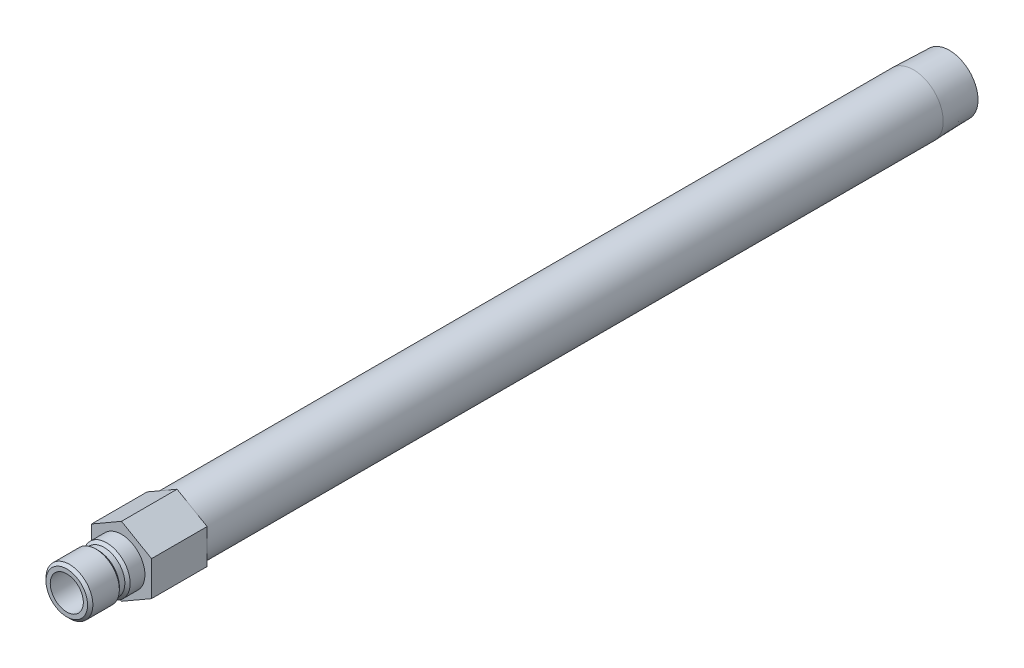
ISO-10303-21;
HEADER;
FILE_DESCRIPTION(('STEP AP214'),'2;1');
FILE_NAME('part.step','',(''),(''),'','','');
FILE_SCHEMA(('AUTOMOTIVE_DESIGN { 1 0 10303 214 1 1 1 1 }'));
ENDSEC;
DATA;
#1=APPLICATION_CONTEXT('core data for automotive mechanical design processes');
#2=APPLICATION_PROTOCOL_DEFINITION('international standard','automotive_design',2000,#1);
#3=PRODUCT_CONTEXT('',#1,'mechanical');
#4=PRODUCT('Part','Part','',(#3));
#5=PRODUCT_RELATED_PRODUCT_CATEGORY('part','',(#4));
#6=PRODUCT_DEFINITION_FORMATION('','',#4);
#7=PRODUCT_DEFINITION_CONTEXT('part definition',#1,'design');
#8=PRODUCT_DEFINITION('design','',#6,#7);
#9=PRODUCT_DEFINITION_SHAPE('','',#8);
#10=(LENGTH_UNIT() NAMED_UNIT(*) SI_UNIT(.MILLI.,.METRE.));
#11=(NAMED_UNIT(*) PLANE_ANGLE_UNIT() SI_UNIT($,.RADIAN.));
#12=(NAMED_UNIT(*) SI_UNIT($,.STERADIAN.) SOLID_ANGLE_UNIT());
#13=UNCERTAINTY_MEASURE_WITH_UNIT(LENGTH_MEASURE(1.E-05),#10,'distance_accuracy_value','');
#14=(GEOMETRIC_REPRESENTATION_CONTEXT(3) GLOBAL_UNCERTAINTY_ASSIGNED_CONTEXT((#13)) GLOBAL_UNIT_ASSIGNED_CONTEXT((#10,
#11,#12)) REPRESENTATION_CONTEXT('',''));
#15=CARTESIAN_POINT('',(0.,0.,0.));
#16=DIRECTION('',(0.,0.,1.));
#17=DIRECTION('',(1.,0.,0.));
#18=AXIS2_PLACEMENT_3D('',#15,#16,#17);
#19=CARTESIAN_POINT('',(0.,0.,0.));
#20=DIRECTION('',(0.,0.,-1.));
#21=DIRECTION('',(0.,1.,0.));
#22=AXIS2_PLACEMENT_3D('',#19,#20,#21);
#23=CYLINDRICAL_SURFACE('',#22,8.57249999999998);
#24=CARTESIAN_POINT('',(0.,0.,-227.9142));
#25=DIRECTION('',(0.,0.,-1.));
#26=DIRECTION('',(0.,1.,0.));
#27=AXIS2_PLACEMENT_3D('',#24,#25,#26);
#28=CIRCLE('',#27,8.57249999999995);
#29=CARTESIAN_POINT('',(0.,8.5725,-227.9142));
#30=VERTEX_POINT('',#29);
#31=EDGE_CURVE('E168',#30,#30,#28,.T.);
#32=ORIENTED_EDGE('',*,*,#31,.F.);
#33=EDGE_LOOP('',(#32));
#34=FACE_BOUND('',#33,.T.);
#35=CARTESIAN_POINT('',(0.,0.,-16.002));
#36=DIRECTION('',(0.,0.,1.));
#37=DIRECTION('',(1.,0.,0.));
#38=AXIS2_PLACEMENT_3D('',#35,#36,#37);
#39=CIRCLE('',#38,8.57249999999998);
#40=CARTESIAN_POINT('',(8.57249999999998,0.,-16.002));
#41=VERTEX_POINT('',#40);
#42=EDGE_CURVE('E37',#41,#41,#39,.F.);
#43=ORIENTED_EDGE('',*,*,#42,.T.);
#44=EDGE_LOOP('',(#43));
#45=FACE_BOUND('',#44,.T.);
#46=ADVANCED_FACE('F33',(#34,#45),#23,.T.);
#47=CARTESIAN_POINT('',(0.,0.,0.));
#48=DIRECTION('',(0.,0.,-1.));
#49=DIRECTION('',(0.,1.,0.));
#50=AXIS2_PLACEMENT_3D('',#47,#48,#49);
#51=CYLINDRICAL_SURFACE('',#50,4.7625);
#52=CARTESIAN_POINT('',(0.,0.,15.748));
#53=DIRECTION('',(0.,0.,-1.));
#54=DIRECTION('',(0.,1.,0.));
#55=AXIS2_PLACEMENT_3D('',#52,#53,#54);
#56=CIRCLE('',#55,4.7625);
#57=CARTESIAN_POINT('',(0.,4.7625,15.748));
#58=VERTEX_POINT('',#57);
#59=EDGE_CURVE('E144',#58,#58,#56,.T.);
#60=ORIENTED_EDGE('',*,*,#59,.F.);
#61=EDGE_LOOP('',(#60));
#62=FACE_BOUND('',#61,.T.);
#63=CARTESIAN_POINT('',(0.,0.,-16.002));
#64=DIRECTION('',(0.,0.,-1.));
#65=DIRECTION('',(0.,1.,0.));
#66=AXIS2_PLACEMENT_3D('',#63,#64,#65);
#67=CIRCLE('',#66,4.76249999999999);
#68=CARTESIAN_POINT('',(0.,4.7625,-16.002));
#69=VERTEX_POINT('',#68);
#70=EDGE_CURVE('E11',#69,#69,#67,.T.);
#71=ORIENTED_EDGE('',*,*,#70,.T.);
#72=EDGE_LOOP('',(#71));
#73=FACE_BOUND('',#72,.T.);
#74=ADVANCED_FACE('F35',(#62,#73),#51,.F.);
#75=CARTESIAN_POINT('',(0.,4.7625,-16.002));
#76=DIRECTION('',(0.,0.,-1.));
#77=DIRECTION('',(0.,1.,0.));
#78=AXIS2_PLACEMENT_3D('',#75,#76,#77);
#79=PLANE('',#78);
#80=CARTESIAN_POINT('',(0.,0.,-16.002));
#81=DIRECTION('',(0.,0.,-1.));
#82=DIRECTION('',(0.,1.,0.));
#83=AXIS2_PLACEMENT_3D('',#80,#81,#82);
#84=CIRCLE('',#83,6.26109999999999);
#85=CARTESIAN_POINT('',(0.,6.2611,-16.002));
#86=VERTEX_POINT('',#85);
#87=EDGE_CURVE('E43',#86,#86,#84,.T.);
#88=ORIENTED_EDGE('',*,*,#87,.T.);
#89=EDGE_LOOP('',(#88));
#90=FACE_BOUND('',#89,.T.);
#91=ORIENTED_EDGE('',*,*,#70,.F.);
#92=EDGE_LOOP('',(#91));
#93=FACE_BOUND('',#92,.T.);
#94=ADVANCED_FACE('F180',(#90,#93),#79,.T.);
#95=CARTESIAN_POINT('',(0.,0.,0.));
#96=DIRECTION('',(0.,0.,-1.));
#97=DIRECTION('',(0.,1.,0.));
#98=AXIS2_PLACEMENT_3D('',#95,#96,#97);
#99=CYLINDRICAL_SURFACE('',#98,6.26109999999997);
#100=CARTESIAN_POINT('',(0.,0.,-238.252));
#101=DIRECTION('',(0.,0.,-1.));
#102=DIRECTION('',(0.,1.,0.));
#103=AXIS2_PLACEMENT_3D('',#100,#101,#102);
#104=CIRCLE('',#103,6.26109999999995);
#105=CARTESIAN_POINT('',(0.,6.2611,-238.252));
#106=VERTEX_POINT('',#105);
#107=EDGE_CURVE('E174',#106,#106,#104,.T.);
#108=ORIENTED_EDGE('',*,*,#107,.T.);
#109=EDGE_LOOP('',(#108));
#110=FACE_BOUND('',#109,.T.);
#111=ORIENTED_EDGE('',*,*,#87,.F.);
#112=EDGE_LOOP('',(#111));
#113=FACE_BOUND('',#112,.T.);
#114=ADVANCED_FACE('F183',(#110,#113),#99,.F.);
#115=CARTESIAN_POINT('',(0.,8.24944566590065,-238.252));
#116=DIRECTION('',(0.,0.,-1.));
#117=DIRECTION('',(0.,1.,0.));
#118=AXIS2_PLACEMENT_3D('',#115,#116,#117);
#119=PLANE('',#118);
#120=CARTESIAN_POINT('',(0.,0.,-238.252));
#121=DIRECTION('',(0.,0.,-1.));
#122=DIRECTION('',(0.,1.,0.));
#123=AXIS2_PLACEMENT_3D('',#120,#121,#122);
#124=CIRCLE('',#123,8.2494456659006);
#125=CARTESIAN_POINT('',(0.,8.24944566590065,-238.252));
#126=VERTEX_POINT('',#125);
#127=EDGE_CURVE('E171',#126,#126,#124,.T.);
#128=ORIENTED_EDGE('',*,*,#127,.T.);
#129=EDGE_LOOP('',(#128));
#130=FACE_BOUND('',#129,.T.);
#131=ORIENTED_EDGE('',*,*,#107,.F.);
#132=EDGE_LOOP('',(#131));
#133=FACE_BOUND('',#132,.T.);
#134=ADVANCED_FACE('F185',(#130,#133),#119,.T.);
#135=CARTESIAN_POINT('',(0.,0.,-238.252));
#136=DIRECTION('',(0.,0.,1.));
#137=DIRECTION('',(0.,-1.,0.));
#138=AXIS2_PLACEMENT_3D('',#135,#136,#137);
#139=CONICAL_SURFACE('',#138,8.2494456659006,0.0312396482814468);
#140=ORIENTED_EDGE('',*,*,#31,.T.);
#141=EDGE_LOOP('',(#140));
#142=FACE_BOUND('',#141,.T.);
#143=ORIENTED_EDGE('',*,*,#127,.F.);
#144=EDGE_LOOP('',(#143));
#145=FACE_BOUND('',#144,.T.);
#146=ADVANCED_FACE('F192',(#142,#145),#139,.T.);
#147=CARTESIAN_POINT('',(0.,6.7437,0.));
#148=DIRECTION('',(0.,0.,1.));
#149=DIRECTION('',(0.,-1.,0.));
#150=AXIS2_PLACEMENT_3D('',#147,#148,#149);
#151=PLANE('',#150);
#152=CARTESIAN_POINT('',(0.,0.,0.));
#153=DIRECTION('',(0.,0.,-1.));
#154=DIRECTION('',(0.,1.,0.));
#155=AXIS2_PLACEMENT_3D('',#152,#153,#154);
#156=CIRCLE('',#155,6.7437);
#157=CARTESIAN_POINT('',(0.,6.7437,0.));
#158=VERTEX_POINT('',#157);
#159=EDGE_CURVE('E165',#158,#158,#156,.T.);
#160=ORIENTED_EDGE('',*,*,#159,.T.);
#161=EDGE_LOOP('',(#160));
#162=FACE_BOUND('',#161,.T.);
#163=DIRECTION('',(-0.866025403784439,-0.5,0.));
#164=VECTOR('',#163,1.);
#165=CARTESIAN_POINT('',(0.,9.97199384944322,0.));
#166=LINE('',#165,#164);
#167=CARTESIAN_POINT('',(0.,9.97199384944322,0.));
#168=VERTEX_POINT('',#167);
#169=CARTESIAN_POINT('',(-8.636,4.98599692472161,0.));
#170=VERTEX_POINT('',#169);
#171=EDGE_CURVE('E122',#168,#170,#166,.T.);
#172=ORIENTED_EDGE('',*,*,#171,.T.);
#173=DIRECTION('',(0.,-1.,0.));
#174=VECTOR('',#173,1.);
#175=CARTESIAN_POINT('',(-8.636,4.98599692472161,0.));
#176=LINE('',#175,#174);
#177=CARTESIAN_POINT('',(-8.636,-4.98599692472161,0.));
#178=VERTEX_POINT('',#177);
#179=EDGE_CURVE('E125',#170,#178,#176,.T.);
#180=ORIENTED_EDGE('',*,*,#179,.T.);
#181=DIRECTION('',(0.866025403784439,-0.5,0.));
#182=VECTOR('',#181,1.);
#183=CARTESIAN_POINT('',(-8.636,-4.98599692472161,0.));
#184=LINE('',#183,#182);
#185=CARTESIAN_POINT('',(0.,-9.97199384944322,0.));
#186=VERTEX_POINT('',#185);
#187=EDGE_CURVE('E128',#178,#186,#184,.T.);
#188=ORIENTED_EDGE('',*,*,#187,.T.);
#189=DIRECTION('',(0.866025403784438,0.5,0.));
#190=VECTOR('',#189,1.);
#191=CARTESIAN_POINT('',(0.,-9.97199384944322,0.));
#192=LINE('',#191,#190);
#193=CARTESIAN_POINT('',(8.63599999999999,-4.98599692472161,0.));
#194=VERTEX_POINT('',#193);
#195=EDGE_CURVE('E131',#186,#194,#192,.T.);
#196=ORIENTED_EDGE('',*,*,#195,.T.);
#197=DIRECTION('',(0.,1.,0.));
#198=VECTOR('',#197,1.);
#199=CARTESIAN_POINT('',(8.63599999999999,-4.98599692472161,0.));
#200=LINE('',#199,#198);
#201=CARTESIAN_POINT('',(8.636,4.98599692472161,0.));
#202=VERTEX_POINT('',#201);
#203=EDGE_CURVE('E99',#194,#202,#200,.T.);
#204=ORIENTED_EDGE('',*,*,#203,.T.);
#205=DIRECTION('',(-0.866025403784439,0.5,0.));
#206=VECTOR('',#205,1.);
#207=CARTESIAN_POINT('',(8.636,4.98599692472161,0.));
#208=LINE('',#207,#206);
#209=EDGE_CURVE('E134',#202,#168,#208,.T.);
#210=ORIENTED_EDGE('',*,*,#209,.T.);
#211=EDGE_LOOP('',(#172,#180,#188,#196,#204,#210));
#212=FACE_BOUND('',#211,.T.);
#213=ADVANCED_FACE('F206',(#162,#212),#151,.T.);
#214=CARTESIAN_POINT('',(0.,0.,0.));
#215=DIRECTION('',(0.,0.,-1.));
#216=DIRECTION('',(0.,1.,0.));
#217=AXIS2_PLACEMENT_3D('',#214,#215,#216);
#218=CYLINDRICAL_SURFACE('',#217,6.7437);
#219=CARTESIAN_POINT('',(0.,0.,4.25449999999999));
#220=DIRECTION('',(0.,0.,-1.));
#221=DIRECTION('',(0.,1.,0.));
#222=AXIS2_PLACEMENT_3D('',#219,#220,#221);
#223=CIRCLE('',#222,6.7437);
#224=CARTESIAN_POINT('',(0.,6.7437,4.2545));
#225=VERTEX_POINT('',#224);
#226=EDGE_CURVE('E162',#225,#225,#223,.T.);
#227=ORIENTED_EDGE('',*,*,#226,.T.);
#228=EDGE_LOOP('',(#227));
#229=FACE_BOUND('',#228,.T.);
#230=ORIENTED_EDGE('',*,*,#159,.F.);
#231=EDGE_LOOP('',(#230));
#232=FACE_BOUND('',#231,.T.);
#233=ADVANCED_FACE('F213',(#229,#232),#218,.T.);
#234=CARTESIAN_POINT('',(0.,0.,4.25449999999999));
#235=DIRECTION('',(0.,0.,-1.));
#236=DIRECTION('',(0.,1.,0.));
#237=AXIS2_PLACEMENT_3D('',#234,#235,#236);
#238=CONICAL_SURFACE('',#237,6.7437,0.785398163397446);
#239=CARTESIAN_POINT('',(0.,0.,5.0165));
#240=DIRECTION('',(0.,0.,-1.));
#241=DIRECTION('',(0.,1.,0.));
#242=AXIS2_PLACEMENT_3D('',#239,#240,#241);
#243=CIRCLE('',#242,5.9817);
#244=CARTESIAN_POINT('',(0.,5.9817,5.0165));
#245=VERTEX_POINT('',#244);
#246=EDGE_CURVE('E159',#245,#245,#243,.T.);
#247=ORIENTED_EDGE('',*,*,#246,.T.);
#248=EDGE_LOOP('',(#247));
#249=FACE_BOUND('',#248,.T.);
#250=ORIENTED_EDGE('',*,*,#226,.F.);
#251=EDGE_LOOP('',(#250));
#252=FACE_BOUND('',#251,.T.);
#253=ADVANCED_FACE('F222',(#249,#252),#238,.T.);
#254=CARTESIAN_POINT('',(0.,0.,0.));
#255=DIRECTION('',(0.,0.,-1.));
#256=DIRECTION('',(0.,1.,0.));
#257=AXIS2_PLACEMENT_3D('',#254,#255,#256);
#258=CYLINDRICAL_SURFACE('',#257,5.9817);
#259=CARTESIAN_POINT('',(0.,0.,6.604));
#260=DIRECTION('',(0.,0.,-1.));
#261=DIRECTION('',(0.,1.,0.));
#262=AXIS2_PLACEMENT_3D('',#259,#260,#261);
#263=CIRCLE('',#262,5.9817);
#264=CARTESIAN_POINT('',(0.,5.9817,6.604));
#265=VERTEX_POINT('',#264);
#266=EDGE_CURVE('E156',#265,#265,#263,.T.);
#267=ORIENTED_EDGE('',*,*,#266,.T.);
#268=EDGE_LOOP('',(#267));
#269=FACE_BOUND('',#268,.T.);
#270=ORIENTED_EDGE('',*,*,#246,.F.);
#271=EDGE_LOOP('',(#270));
#272=FACE_BOUND('',#271,.T.);
#273=ADVANCED_FACE('F263',(#269,#272),#258,.T.);
#274=CARTESIAN_POINT('',(0.,0.,6.604));
#275=DIRECTION('',(0.,0.,1.));
#276=DIRECTION('',(0.,-1.,0.));
#277=AXIS2_PLACEMENT_3D('',#274,#275,#276);
#278=CONICAL_SURFACE('',#277,5.9817,0.785398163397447);
#279=CARTESIAN_POINT('',(0.,0.,7.366));
#280=DIRECTION('',(0.,0.,-1.));
#281=DIRECTION('',(0.,1.,0.));
#282=AXIS2_PLACEMENT_3D('',#279,#280,#281);
#283=CIRCLE('',#282,6.7437);
#284=CARTESIAN_POINT('',(0.,6.7437,7.366));
#285=VERTEX_POINT('',#284);
#286=EDGE_CURVE('E153',#285,#285,#283,.T.);
#287=ORIENTED_EDGE('',*,*,#286,.T.);
#288=EDGE_LOOP('',(#287));
#289=FACE_BOUND('',#288,.T.);
#290=ORIENTED_EDGE('',*,*,#266,.F.);
#291=EDGE_LOOP('',(#290));
#292=FACE_BOUND('',#291,.T.);
#293=ADVANCED_FACE('F259',(#289,#292),#278,.T.);
#294=CARTESIAN_POINT('',(0.,0.,0.));
#295=DIRECTION('',(0.,0.,-1.));
#296=DIRECTION('',(0.,1.,0.));
#297=AXIS2_PLACEMENT_3D('',#294,#295,#296);
#298=CYLINDRICAL_SURFACE('',#297,6.7437);
#299=CARTESIAN_POINT('',(0.,0.,14.986));
#300=DIRECTION('',(0.,0.,-1.));
#301=DIRECTION('',(0.,1.,0.));
#302=AXIS2_PLACEMENT_3D('',#299,#300,#301);
#303=CIRCLE('',#302,6.7437);
#304=CARTESIAN_POINT('',(0.,6.7437,14.986));
#305=VERTEX_POINT('',#304);
#306=EDGE_CURVE('E150',#305,#305,#303,.T.);
#307=ORIENTED_EDGE('',*,*,#306,.T.);
#308=EDGE_LOOP('',(#307));
#309=FACE_BOUND('',#308,.T.);
#310=ORIENTED_EDGE('',*,*,#286,.F.);
#311=EDGE_LOOP('',(#310));
#312=FACE_BOUND('',#311,.T.);
#313=ADVANCED_FACE('F255',(#309,#312),#298,.T.);
#314=CARTESIAN_POINT('',(0.,0.,14.986));
#315=DIRECTION('',(0.,0.,-1.));
#316=DIRECTION('',(0.,1.,0.));
#317=AXIS2_PLACEMENT_3D('',#314,#315,#316);
#318=CONICAL_SURFACE('',#317,6.7437,0.785398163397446);
#319=CARTESIAN_POINT('',(0.,0.,15.748));
#320=DIRECTION('',(0.,0.,-1.));
#321=DIRECTION('',(0.,1.,0.));
#322=AXIS2_PLACEMENT_3D('',#319,#320,#321);
#323=CIRCLE('',#322,5.9817);
#324=CARTESIAN_POINT('',(0.,5.9817,15.748));
#325=VERTEX_POINT('',#324);
#326=EDGE_CURVE('E147',#325,#325,#323,.T.);
#327=ORIENTED_EDGE('',*,*,#326,.T.);
#328=EDGE_LOOP('',(#327));
#329=FACE_BOUND('',#328,.T.);
#330=ORIENTED_EDGE('',*,*,#306,.F.);
#331=EDGE_LOOP('',(#330));
#332=FACE_BOUND('',#331,.T.);
#333=ADVANCED_FACE('F251',(#329,#332),#318,.T.);
#334=CARTESIAN_POINT('',(0.,4.7625,15.748));
#335=DIRECTION('',(0.,0.,1.));
#336=DIRECTION('',(0.,-1.,0.));
#337=AXIS2_PLACEMENT_3D('',#334,#335,#336);
#338=PLANE('',#337);
#339=ORIENTED_EDGE('',*,*,#59,.T.);
#340=EDGE_LOOP('',(#339));
#341=FACE_BOUND('',#340,.T.);
#342=ORIENTED_EDGE('',*,*,#326,.F.);
#343=EDGE_LOOP('',(#342));
#344=FACE_BOUND('',#343,.T.);
#345=ADVANCED_FACE('F239',(#341,#344),#338,.T.);
#346=CARTESIAN_POINT('',(0.,9.97199384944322,-16.002));
#347=DIRECTION('',(-0.5,0.866025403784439,0.));
#348=DIRECTION('',(-0.866025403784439,-0.5,0.));
#349=AXIS2_PLACEMENT_3D('',#346,#347,#348);
#350=PLANE('',#349);
#351=ORIENTED_EDGE('',*,*,#171,.F.);
#352=DIRECTION('',(0.,0.,1.));
#353=VECTOR('',#352,1.);
#354=CARTESIAN_POINT('',(0.,9.97199384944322,-16.002));
#355=LINE('',#354,#353);
#356=CARTESIAN_POINT('',(0.,9.97199384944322,-16.002));
#357=VERTEX_POINT('',#356);
#358=EDGE_CURVE('E51',#357,#168,#355,.T.);
#359=ORIENTED_EDGE('',*,*,#358,.F.);
#360=DIRECTION('',(-0.866025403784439,-0.5,0.));
#361=VECTOR('',#360,1.);
#362=CARTESIAN_POINT('',(0.,9.97199384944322,-16.002));
#363=LINE('',#362,#361);
#364=CARTESIAN_POINT('',(-8.636,4.98599692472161,-16.002));
#365=VERTEX_POINT('',#364);
#366=EDGE_CURVE('E137',#357,#365,#363,.T.);
#367=ORIENTED_EDGE('',*,*,#366,.T.);
#368=DIRECTION('',(0.,0.,1.));
#369=VECTOR('',#368,1.);
#370=CARTESIAN_POINT('',(-8.636,4.98599692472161,-16.002));
#371=LINE('',#370,#369);
#372=EDGE_CURVE('E86',#365,#170,#371,.T.);
#373=ORIENTED_EDGE('',*,*,#372,.T.);
#374=EDGE_LOOP('',(#351,#359,#367,#373));
#375=FACE_BOUND('',#374,.T.);
#376=ADVANCED_FACE('F226',(#375),#350,.T.);
#377=CARTESIAN_POINT('',(8.636,4.98599692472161,-16.002));
#378=DIRECTION('',(0.5,0.866025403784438,0.));
#379=DIRECTION('',(-0.866025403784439,0.5,0.));
#380=AXIS2_PLACEMENT_3D('',#377,#378,#379);
#381=PLANE('',#380);
#382=ORIENTED_EDGE('',*,*,#209,.F.);
#383=DIRECTION('',(0.,0.,1.));
#384=VECTOR('',#383,1.);
#385=CARTESIAN_POINT('',(8.636,4.98599692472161,-16.002));
#386=LINE('',#385,#384);
#387=CARTESIAN_POINT('',(8.636,4.98599692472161,-16.002));
#388=VERTEX_POINT('',#387);
#389=EDGE_CURVE('E74',#388,#202,#386,.T.);
#390=ORIENTED_EDGE('',*,*,#389,.F.);
#391=DIRECTION('',(-0.866025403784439,0.5,0.));
#392=VECTOR('',#391,1.);
#393=CARTESIAN_POINT('',(8.636,4.98599692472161,-16.002));
#394=LINE('',#393,#392);
#395=EDGE_CURVE('E112',#388,#357,#394,.T.);
#396=ORIENTED_EDGE('',*,*,#395,.T.);
#397=ORIENTED_EDGE('',*,*,#358,.T.);
#398=EDGE_LOOP('',(#382,#390,#396,#397));
#399=FACE_BOUND('',#398,.T.);
#400=ADVANCED_FACE('F231',(#399),#381,.T.);
#401=CARTESIAN_POINT('',(8.63599999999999,-4.98599692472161,-16.002));
#402=DIRECTION('',(1.,0.,0.));
#403=DIRECTION('',(0.,1.,0.));
#404=AXIS2_PLACEMENT_3D('',#401,#402,#403);
#405=PLANE('',#404);
#406=ORIENTED_EDGE('',*,*,#203,.F.);
#407=DIRECTION('',(0.,0.,1.));
#408=VECTOR('',#407,1.);
#409=CARTESIAN_POINT('',(8.63599999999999,-4.98599692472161,-16.002));
#410=LINE('',#409,#408);
#411=CARTESIAN_POINT('',(8.63599999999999,-4.98599692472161,-16.002));
#412=VERTEX_POINT('',#411);
#413=EDGE_CURVE('E94',#412,#194,#410,.T.);
#414=ORIENTED_EDGE('',*,*,#413,.F.);
#415=DIRECTION('',(0.,1.,0.));
#416=VECTOR('',#415,1.);
#417=CARTESIAN_POINT('',(8.63599999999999,-4.98599692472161,-16.002));
#418=LINE('',#417,#416);
#419=EDGE_CURVE('E97',#412,#388,#418,.T.);
#420=ORIENTED_EDGE('',*,*,#419,.T.);
#421=ORIENTED_EDGE('',*,*,#389,.T.);
#422=EDGE_LOOP('',(#406,#414,#420,#421));
#423=FACE_BOUND('',#422,.T.);
#424=ADVANCED_FACE('F96',(#423),#405,.T.);
#425=CARTESIAN_POINT('',(0.,-9.97199384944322,-16.002));
#426=DIRECTION('',(0.5,-0.866025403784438,0.));
#427=DIRECTION('',(0.866025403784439,0.5,0.));
#428=AXIS2_PLACEMENT_3D('',#425,#426,#427);
#429=PLANE('',#428);
#430=ORIENTED_EDGE('',*,*,#195,.F.);
#431=DIRECTION('',(0.,0.,1.));
#432=VECTOR('',#431,1.);
#433=CARTESIAN_POINT('',(0.,-9.97199384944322,-16.002));
#434=LINE('',#433,#432);
#435=CARTESIAN_POINT('',(0.,-9.97199384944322,-16.002));
#436=VERTEX_POINT('',#435);
#437=EDGE_CURVE('E104',#436,#186,#434,.T.);
#438=ORIENTED_EDGE('',*,*,#437,.F.);
#439=DIRECTION('',(0.866025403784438,0.5,0.));
#440=VECTOR('',#439,1.);
#441=CARTESIAN_POINT('',(0.,-9.97199384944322,-16.002));
#442=LINE('',#441,#440);
#443=EDGE_CURVE('E110',#436,#412,#442,.T.);
#444=ORIENTED_EDGE('',*,*,#443,.T.);
#445=ORIENTED_EDGE('',*,*,#413,.T.);
#446=EDGE_LOOP('',(#430,#438,#444,#445));
#447=FACE_BOUND('',#446,.T.);
#448=ADVANCED_FACE('F114',(#447),#429,.T.);
#449=CARTESIAN_POINT('',(-8.636,-4.98599692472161,-16.002));
#450=DIRECTION('',(-0.5,-0.866025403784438,0.));
#451=DIRECTION('',(0.866025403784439,-0.5,0.));
#452=AXIS2_PLACEMENT_3D('',#449,#450,#451);
#453=PLANE('',#452);
#454=ORIENTED_EDGE('',*,*,#187,.F.);
#455=DIRECTION('',(0.,0.,1.));
#456=VECTOR('',#455,1.);
#457=CARTESIAN_POINT('',(-8.636,-4.98599692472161,-16.002));
#458=LINE('',#457,#456);
#459=CARTESIAN_POINT('',(-8.636,-4.98599692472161,-16.002));
#460=VERTEX_POINT('',#459);
#461=EDGE_CURVE('E141',#460,#178,#458,.T.);
#462=ORIENTED_EDGE('',*,*,#461,.F.);
#463=DIRECTION('',(0.866025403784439,-0.5,0.));
#464=VECTOR('',#463,1.);
#465=CARTESIAN_POINT('',(-8.636,-4.98599692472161,-16.002));
#466=LINE('',#465,#464);
#467=EDGE_CURVE('E115',#460,#436,#466,.T.);
#468=ORIENTED_EDGE('',*,*,#467,.T.);
#469=ORIENTED_EDGE('',*,*,#437,.T.);
#470=EDGE_LOOP('',(#454,#462,#468,#469));
#471=FACE_BOUND('',#470,.T.);
#472=ADVANCED_FACE('F230',(#471),#453,.T.);
#473=CARTESIAN_POINT('',(-8.636,4.98599692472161,-16.002));
#474=DIRECTION('',(-1.,0.,0.));
#475=DIRECTION('',(0.,0.,1.));
#476=AXIS2_PLACEMENT_3D('',#473,#474,#475);
#477=PLANE('',#476);
#478=ORIENTED_EDGE('',*,*,#179,.F.);
#479=ORIENTED_EDGE('',*,*,#372,.F.);
#480=DIRECTION('',(0.,-1.,0.));
#481=VECTOR('',#480,1.);
#482=CARTESIAN_POINT('',(-8.636,4.98599692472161,-16.002));
#483=LINE('',#482,#481);
#484=EDGE_CURVE('E117',#365,#460,#483,.T.);
#485=ORIENTED_EDGE('',*,*,#484,.T.);
#486=ORIENTED_EDGE('',*,*,#461,.T.);
#487=EDGE_LOOP('',(#478,#479,#485,#486));
#488=FACE_BOUND('',#487,.T.);
#489=ADVANCED_FACE('F227',(#488),#477,.T.);
#490=CARTESIAN_POINT('',(-8.636,4.98599692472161,-16.002));
#491=DIRECTION('',(0.,0.,1.));
#492=DIRECTION('',(1.,0.,0.));
#493=AXIS2_PLACEMENT_3D('',#490,#491,#492);
#494=PLANE('',#493);
#495=ORIENTED_EDGE('',*,*,#42,.F.);
#496=EDGE_LOOP('',(#495));
#497=FACE_BOUND('',#496,.T.);
#498=ORIENTED_EDGE('',*,*,#366,.F.);
#499=ORIENTED_EDGE('',*,*,#395,.F.);
#500=ORIENTED_EDGE('',*,*,#419,.F.);
#501=ORIENTED_EDGE('',*,*,#443,.F.);
#502=ORIENTED_EDGE('',*,*,#467,.F.);
#503=ORIENTED_EDGE('',*,*,#484,.F.);
#504=EDGE_LOOP('',(#498,#499,#500,#501,#502,#503));
#505=FACE_BOUND('',#504,.T.);
#506=ADVANCED_FACE('F108',(#497,#505),#494,.F.);
#507=CLOSED_SHELL('',(#46,#74,#94,#114,#134,#146,#213,#233,#253,#273,#293,#313,#333,#345,#376,
#400,#424,#448,#472,#489,#506));
#508=MANIFOLD_SOLID_BREP('B2',#507);
#509=ADVANCED_BREP_SHAPE_REPRESENTATION('',(#18,#508),#14);
#510=SHAPE_DEFINITION_REPRESENTATION(#9,#509);
ENDSEC;
END-ISO-10303-21;
